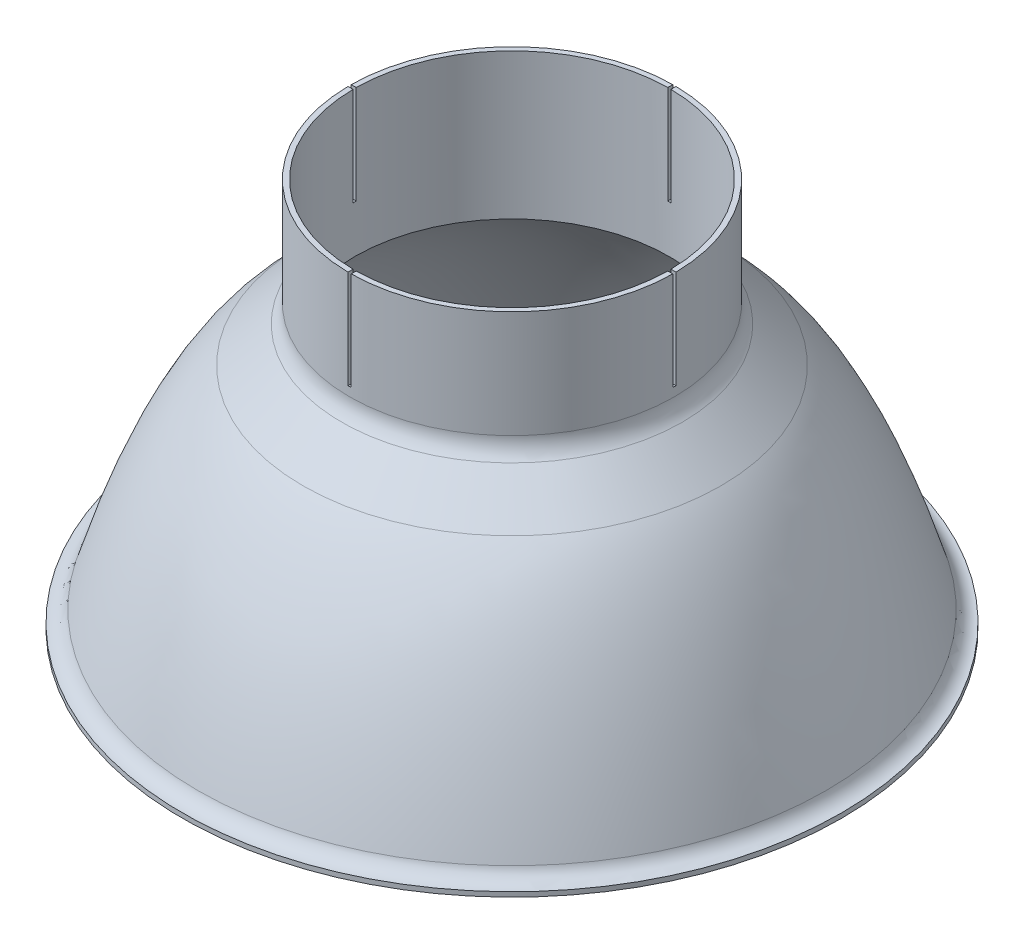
from build123d import *

# Parameters (mm, degrees)
FILLET1_R           = 7.9375
EXTRUDE1_DEPTH      = 180.742805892
EXTRUDE1_DEPTH_BACK = 180.742805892
SKETCH3_W           = 1.016
SKETCH3_H           = 53.073476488
EXTRUDE2_DEPTH      = 180.742805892
EXTRUDE2_DEPTH_BACK = 180.742805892
SKETCH4_W           = 1.016
SKETCH4_H           = 42.519794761


with BuildPart() as part:
    # Sketch1 → Revolve2 (revolve)
    with BuildSketch(Plane.XY, mode=Mode.PRIVATE) as revolve2_sk:
        with BuildLine():
            Line((67.447242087, -24.828195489), (50.8, -9.416528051))
            Line((50.8, -9.416528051), (50.8, -19.829472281))
            add(Edge.make_bspline(
                [(50.8, -19.829472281), (75.401613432, -19.829472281), (100.003226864, -93.70557646)],
                knots=[0, 0, 0, 1, 1, 1], degree=2))
            ThreePointArc((100.003226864, -93.70557646), (102.456483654, -97.043598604), (106.398629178, -98.316528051))
            Line((106.398629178, -98.316528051), (106.398629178, -96.790377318))
            ThreePointArc((106.398629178, -96.790377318), (103.277888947, -95.753446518), (101.398289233, -93.055048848))
            add(Edge.make_bspline(
                [(67.447242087, -24.828195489), (68.042737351, -25.379492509), (69.322304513, -26.622411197), (72.907335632, -30.462372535), (78.042953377, -37.231318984), (84.431184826, -48.237344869), (89.5073158, -59.203558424), (93.43071892, -69.060575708), (96.305237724, -76.993349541), (98.648434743, -84.066290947), (100.331466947, -89.483719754), (101.096303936, -92.03421863), (101.398289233, -93.055048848)],
                knots=[0.502588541, 0.502588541, 0.502588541, 0.502588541, 0.502851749, 0.503158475, 0.504211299, 0.505264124, 0.506316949, 0.506843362, 0.507369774, 0.507896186, 0.508159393, 0.50833472, 0.50833472, 0.50833472, 0.50833472], degree=3))
        make_face()
    revolve(revolve2_sk.sketch.rotate(Axis((0, 0, 0), (0, -1, 0)), 180), axis=Axis((0, 0, 0), (0, -1, 0)))

    # Sketch2 → Revolve3 (revolve)
    with BuildSketch(Plane.XY, mode=Mode.PRIVATE) as revolve3_sk:
        Polygon((50.8, 27.178525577), (50.8, -16.449922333), (52.4256, -10.921474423), (52.4256, 27.178525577), align=None)
    revolve(revolve3_sk.sketch.rotate(Axis((0, 0, 0), (0, -1, 0)), 180), axis=Axis((0, 0, 0), (0, -1, 0)))

    # Fillet1
    fillet1_edges = [part.edges().sort_by_distance(p)[0] for p in [
        (52.4256, -10.921474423, 0),
    ]]
    fillet(fillet1_edges, radius=FILLET1_R)

    # Sketch3 → Extrude1 (cut, two sides: drawn at the far end of the back side and taken through both)
    with BuildSketch(Plane.XY.offset(-EXTRUDE1_DEPTH_BACK)):
        with Locations((0, 21.965263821)):
            Rectangle(SKETCH3_W, SKETCH3_H)
    extrude(amount=EXTRUDE1_DEPTH + EXTRUDE1_DEPTH_BACK, mode=Mode.SUBTRACT)

    # Sketch4 → Extrude2 (cut, two sides: drawn at the far end of the back side and taken through both)
    with BuildSketch(Plane(origin=(0, 0, 0), x_dir=(0, 0, -1), z_dir=(1, 0, 0)).offset(-EXTRUDE2_DEPTH_BACK)):
        with Locations((0, 16.688422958)):
            Rectangle(SKETCH4_W, SKETCH4_H)
    extrude(amount=EXTRUDE2_DEPTH + EXTRUDE2_DEPTH_BACK, mode=Mode.SUBTRACT)


solid = part.part
